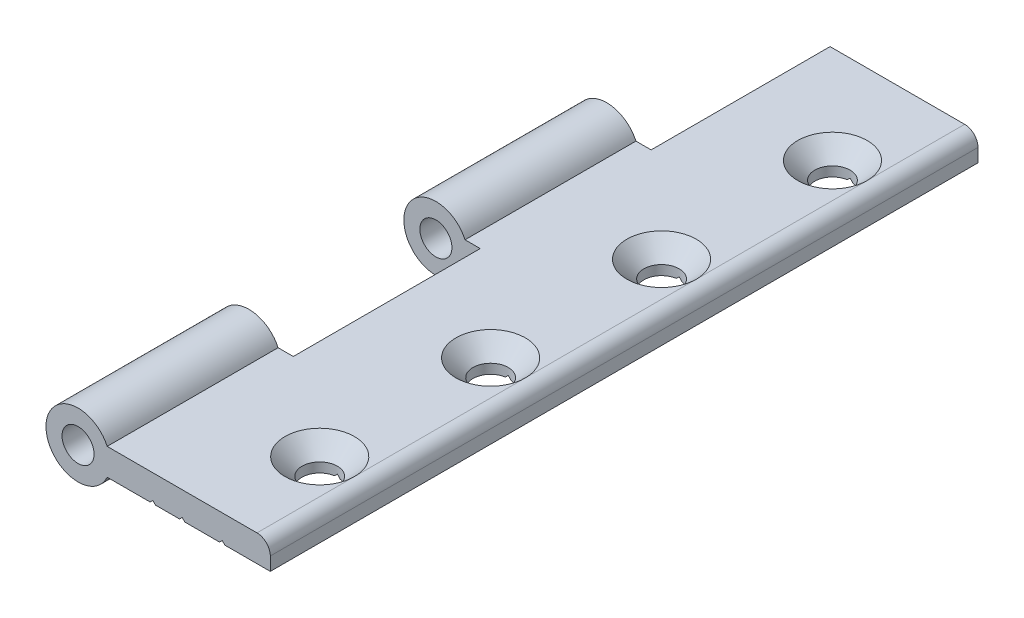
ISO-10303-21;
HEADER;
FILE_DESCRIPTION(('STEP AP214'),'2;1');
FILE_NAME('part.step','',(''),(''),'','','');
FILE_SCHEMA(('AUTOMOTIVE_DESIGN { 1 0 10303 214 1 1 1 1 }'));
ENDSEC;
DATA;
#1=APPLICATION_CONTEXT('core data for automotive mechanical design processes');
#2=APPLICATION_PROTOCOL_DEFINITION('international standard','automotive_design',2000,#1);
#3=PRODUCT_CONTEXT('',#1,'mechanical');
#4=PRODUCT('Part','Part','',(#3));
#5=PRODUCT_RELATED_PRODUCT_CATEGORY('part','',(#4));
#6=PRODUCT_DEFINITION_FORMATION('','',#4);
#7=PRODUCT_DEFINITION_CONTEXT('part definition',#1,'design');
#8=PRODUCT_DEFINITION('design','',#6,#7);
#9=PRODUCT_DEFINITION_SHAPE('','',#8);
#10=(LENGTH_UNIT() NAMED_UNIT(*) SI_UNIT(.MILLI.,.METRE.));
#11=(NAMED_UNIT(*) PLANE_ANGLE_UNIT() SI_UNIT($,.RADIAN.));
#12=(NAMED_UNIT(*) SI_UNIT($,.STERADIAN.) SOLID_ANGLE_UNIT());
#13=UNCERTAINTY_MEASURE_WITH_UNIT(LENGTH_MEASURE(1.E-05),#10,'distance_accuracy_value','');
#14=(GEOMETRIC_REPRESENTATION_CONTEXT(3) GLOBAL_UNCERTAINTY_ASSIGNED_CONTEXT((#13)) GLOBAL_UNIT_ASSIGNED_CONTEXT((#10,
#11,#12)) REPRESENTATION_CONTEXT('',''));
#15=CARTESIAN_POINT('',(0.,0.,0.));
#16=DIRECTION('',(0.,0.,1.));
#17=DIRECTION('',(1.,0.,0.));
#18=AXIS2_PLACEMENT_3D('',#15,#16,#17);
#19=CARTESIAN_POINT('',(27.,2.5,18.25));
#20=DIRECTION('',(0.,1.,0.));
#21=DIRECTION('',(-1.,0.,0.));
#22=AXIS2_PLACEMENT_3D('',#19,#20,#21);
#23=CONICAL_SURFACE('',#22,6.50000000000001,0.785398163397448);
#24=CARTESIAN_POINT('',(27.,-0.700000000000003,18.25));
#25=DIRECTION('',(0.,1.,0.));
#26=DIRECTION('',(0.,0.,1.));
#27=AXIS2_PLACEMENT_3D('',#24,#25,#26);
#28=CIRCLE('',#27,3.3);
#29=CARTESIAN_POINT('',(27.,-0.700000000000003,21.55));
#30=VERTEX_POINT('',#29);
#31=EDGE_CURVE('E303',#30,#30,#28,.T.);
#32=ORIENTED_EDGE('',*,*,#31,.F.);
#33=EDGE_LOOP('',(#32));
#34=FACE_BOUND('',#33,.T.);
#35=CARTESIAN_POINT('',(27.,2.5,18.25));
#36=DIRECTION('',(0.,1.,0.));
#37=DIRECTION('',(-1.,0.,0.));
#38=AXIS2_PLACEMENT_3D('',#35,#36,#37);
#39=CIRCLE('',#38,6.5);
#40=CARTESIAN_POINT('',(33.5,2.5,18.25));
#41=VERTEX_POINT('',#40);
#42=EDGE_CURVE('E100',#41,#41,#39,.T.);
#43=ORIENTED_EDGE('',*,*,#42,.T.);
#44=EDGE_LOOP('',(#43));
#45=FACE_BOUND('',#44,.T.);
#46=ADVANCED_FACE('F15',(#34,#45),#23,.F.);
#47=CARTESIAN_POINT('',(27.,-0.699999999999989,18.25));
#48=DIRECTION('',(0.,-1.,0.));
#49=DIRECTION('',(0.,0.,-1.));
#50=AXIS2_PLACEMENT_3D('',#47,#48,#49);
#51=CYLINDRICAL_SURFACE('',#50,3.3);
#52=ORIENTED_EDGE('',*,*,#31,.T.);
#53=EDGE_LOOP('',(#52));
#54=FACE_BOUND('',#53,.T.);
#55=CARTESIAN_POINT('',(27.,-1.99999999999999,18.25));
#56=DIRECTION('',(-0.707106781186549,-0.707106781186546,0.));
#57=DIRECTION('',(0.707106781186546,-0.707106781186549,0.));
#58=AXIS2_PLACEMENT_3D('',#55,#56,#57);
#59=ELLIPSE('',#58,4.66690475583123,3.3);
#60=CARTESIAN_POINT('',(27.,-1.99999999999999,21.55));
#61=VERTEX_POINT('',#60);
#62=CARTESIAN_POINT('',(27.5,-2.5,21.51190128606));
#63=VERTEX_POINT('',#62);
#64=EDGE_CURVE('E291',#61,#63,#59,.F.);
#65=ORIENTED_EDGE('',*,*,#64,.F.);
#66=CARTESIAN_POINT('',(27.,-2.,18.25));
#67=DIRECTION('',(0.707106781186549,-0.707106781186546,0.));
#68=DIRECTION('',(-0.707106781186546,-0.707106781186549,0.));
#69=AXIS2_PLACEMENT_3D('',#66,#67,#68);
#70=ELLIPSE('',#69,4.66690475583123,3.3);
#71=CARTESIAN_POINT('',(26.5,-2.5,21.51190128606));
#72=VERTEX_POINT('',#71);
#73=EDGE_CURVE('E294',#72,#61,#70,.F.);
#74=ORIENTED_EDGE('',*,*,#73,.F.);
#75=CARTESIAN_POINT('',(27.,-2.5,18.25));
#76=DIRECTION('',(0.,-1.,0.));
#77=DIRECTION('',(0.,0.,-1.));
#78=AXIS2_PLACEMENT_3D('',#75,#76,#77);
#79=CIRCLE('',#78,3.3);
#80=CARTESIAN_POINT('',(26.5,-2.5,14.98809871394));
#81=VERTEX_POINT('',#80);
#82=EDGE_CURVE('E314',#81,#72,#79,.F.);
#83=ORIENTED_EDGE('',*,*,#82,.F.);
#84=CARTESIAN_POINT('',(27.,-2.,18.25));
#85=DIRECTION('',(0.707106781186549,-0.707106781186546,0.));
#86=DIRECTION('',(-0.707106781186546,-0.707106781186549,0.));
#87=AXIS2_PLACEMENT_3D('',#84,#85,#86);
#88=ELLIPSE('',#87,4.66690475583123,3.3);
#89=CARTESIAN_POINT('',(27.,-1.99999999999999,14.95));
#90=VERTEX_POINT('',#89);
#91=EDGE_CURVE('E428',#90,#81,#88,.F.);
#92=ORIENTED_EDGE('',*,*,#91,.F.);
#93=CARTESIAN_POINT('',(27.,-1.99999999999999,18.25));
#94=DIRECTION('',(-0.707106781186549,-0.707106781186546,0.));
#95=DIRECTION('',(0.707106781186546,-0.707106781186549,0.));
#96=AXIS2_PLACEMENT_3D('',#93,#94,#95);
#97=ELLIPSE('',#96,4.66690475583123,3.3);
#98=CARTESIAN_POINT('',(27.5,-2.5,14.98809871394));
#99=VERTEX_POINT('',#98);
#100=EDGE_CURVE('E696',#99,#90,#97,.F.);
#101=ORIENTED_EDGE('',*,*,#100,.F.);
#102=CARTESIAN_POINT('',(27.,-2.5,18.25));
#103=DIRECTION('',(0.,-1.,0.));
#104=DIRECTION('',(0.,0.,-1.));
#105=AXIS2_PLACEMENT_3D('',#102,#103,#104);
#106=CIRCLE('',#105,3.3);
#107=EDGE_CURVE('E297',#63,#99,#106,.F.);
#108=ORIENTED_EDGE('',*,*,#107,.F.);
#109=EDGE_LOOP('',(#65,#74,#83,#92,#101,#108));
#110=FACE_BOUND('',#109,.T.);
#111=ADVANCED_FACE('F293',(#54,#110),#51,.F.);
#112=CARTESIAN_POINT('',(27.,2.5,50.25));
#113=DIRECTION('',(0.,1.,0.));
#114=DIRECTION('',(0.,0.,1.));
#115=AXIS2_PLACEMENT_3D('',#112,#113,#114);
#116=CONICAL_SURFACE('',#115,6.50000000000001,0.785398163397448);
#117=CARTESIAN_POINT('',(27.,-0.700000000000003,50.25));
#118=DIRECTION('',(0.,1.,0.));
#119=DIRECTION('',(0.,0.,1.));
#120=AXIS2_PLACEMENT_3D('',#117,#118,#119);
#121=CIRCLE('',#120,3.30000000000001);
#122=CARTESIAN_POINT('',(27.,-0.700000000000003,53.55));
#123=VERTEX_POINT('',#122);
#124=EDGE_CURVE('E620',#123,#123,#121,.T.);
#125=ORIENTED_EDGE('',*,*,#124,.F.);
#126=EDGE_LOOP('',(#125));
#127=FACE_BOUND('',#126,.T.);
#128=CARTESIAN_POINT('',(27.,2.49999999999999,50.25));
#129=DIRECTION('',(0.,1.,0.));
#130=DIRECTION('',(0.,0.,1.));
#131=AXIS2_PLACEMENT_3D('',#128,#129,#130);
#132=CIRCLE('',#131,6.5);
#133=CARTESIAN_POINT('',(33.5,2.5,50.25));
#134=VERTEX_POINT('',#133);
#135=EDGE_CURVE('E10',#134,#134,#132,.T.);
#136=ORIENTED_EDGE('',*,*,#135,.T.);
#137=EDGE_LOOP('',(#136));
#138=FACE_BOUND('',#137,.T.);
#139=ADVANCED_FACE('F714',(#127,#138),#116,.F.);
#140=CARTESIAN_POINT('',(27.,-0.699999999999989,50.25));
#141=DIRECTION('',(0.,-1.,0.));
#142=DIRECTION('',(0.,0.,-1.));
#143=AXIS2_PLACEMENT_3D('',#140,#141,#142);
#144=CYLINDRICAL_SURFACE('',#143,3.30000000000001);
#145=ORIENTED_EDGE('',*,*,#124,.T.);
#146=EDGE_LOOP('',(#145));
#147=FACE_BOUND('',#146,.T.);
#148=CARTESIAN_POINT('',(27.,-2.,50.25));
#149=DIRECTION('',(-0.707106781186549,-0.707106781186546,0.));
#150=DIRECTION('',(0.707106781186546,-0.707106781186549,0.));
#151=AXIS2_PLACEMENT_3D('',#148,#149,#150);
#152=ELLIPSE('',#151,4.66690475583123,3.30000000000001);
#153=CARTESIAN_POINT('',(27.,-1.99999999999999,53.55));
#154=VERTEX_POINT('',#153);
#155=CARTESIAN_POINT('',(27.5,-2.5,53.51190128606));
#156=VERTEX_POINT('',#155);
#157=EDGE_CURVE('E616',#154,#156,#152,.F.);
#158=ORIENTED_EDGE('',*,*,#157,.F.);
#159=CARTESIAN_POINT('',(27.,-2.,50.25));
#160=DIRECTION('',(0.707106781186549,-0.707106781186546,0.));
#161=DIRECTION('',(-0.707106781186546,-0.707106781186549,0.));
#162=AXIS2_PLACEMENT_3D('',#159,#160,#161);
#163=ELLIPSE('',#162,4.66690475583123,3.30000000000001);
#164=CARTESIAN_POINT('',(26.5,-2.5,53.51190128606));
#165=VERTEX_POINT('',#164);
#166=EDGE_CURVE('E619',#165,#154,#163,.F.);
#167=ORIENTED_EDGE('',*,*,#166,.F.);
#168=CARTESIAN_POINT('',(27.,-2.5,50.25));
#169=DIRECTION('',(0.,-1.,0.));
#170=DIRECTION('',(0.,0.,-1.));
#171=AXIS2_PLACEMENT_3D('',#168,#169,#170);
#172=CIRCLE('',#171,3.30000000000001);
#173=CARTESIAN_POINT('',(26.5,-2.5,46.98809871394));
#174=VERTEX_POINT('',#173);
#175=EDGE_CURVE('E687',#174,#165,#172,.F.);
#176=ORIENTED_EDGE('',*,*,#175,.F.);
#177=CARTESIAN_POINT('',(27.,-2.,50.25));
#178=DIRECTION('',(0.707106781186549,-0.707106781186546,0.));
#179=DIRECTION('',(-0.707106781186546,-0.707106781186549,0.));
#180=AXIS2_PLACEMENT_3D('',#177,#178,#179);
#181=ELLIPSE('',#180,4.66690475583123,3.30000000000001);
#182=CARTESIAN_POINT('',(27.,-1.99999999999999,46.95));
#183=VERTEX_POINT('',#182);
#184=EDGE_CURVE('E629',#183,#174,#181,.F.);
#185=ORIENTED_EDGE('',*,*,#184,.F.);
#186=CARTESIAN_POINT('',(27.,-2.,50.25));
#187=DIRECTION('',(-0.707106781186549,-0.707106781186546,0.));
#188=DIRECTION('',(0.707106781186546,-0.707106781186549,0.));
#189=AXIS2_PLACEMENT_3D('',#186,#187,#188);
#190=ELLIPSE('',#189,4.66690475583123,3.30000000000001);
#191=CARTESIAN_POINT('',(27.5,-2.5,46.98809871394));
#192=VERTEX_POINT('',#191);
#193=EDGE_CURVE('E318',#192,#183,#190,.F.);
#194=ORIENTED_EDGE('',*,*,#193,.F.);
#195=CARTESIAN_POINT('',(27.,-2.5,50.25));
#196=DIRECTION('',(0.,-1.,0.));
#197=DIRECTION('',(0.,0.,-1.));
#198=AXIS2_PLACEMENT_3D('',#195,#196,#197);
#199=CIRCLE('',#198,3.30000000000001);
#200=EDGE_CURVE('E609',#156,#192,#199,.F.);
#201=ORIENTED_EDGE('',*,*,#200,.F.);
#202=EDGE_LOOP('',(#158,#167,#176,#185,#194,#201));
#203=FACE_BOUND('',#202,.T.);
#204=ADVANCED_FACE('F622',(#147,#203),#144,.F.);
#205=CARTESIAN_POINT('',(27.,2.5,82.25));
#206=DIRECTION('',(0.,1.,0.));
#207=DIRECTION('',(0.,0.,1.));
#208=AXIS2_PLACEMENT_3D('',#205,#206,#207);
#209=CONICAL_SURFACE('',#208,6.5,0.785398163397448);
#210=CARTESIAN_POINT('',(27.,-0.700000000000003,82.25));
#211=DIRECTION('',(0.,1.,0.));
#212=DIRECTION('',(0.,0.,1.));
#213=AXIS2_PLACEMENT_3D('',#210,#211,#212);
#214=CIRCLE('',#213,3.3);
#215=CARTESIAN_POINT('',(27.,-0.700000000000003,85.55));
#216=VERTEX_POINT('',#215);
#217=EDGE_CURVE('E623',#216,#216,#214,.T.);
#218=ORIENTED_EDGE('',*,*,#217,.F.);
#219=EDGE_LOOP('',(#218));
#220=FACE_BOUND('',#219,.T.);
#221=CARTESIAN_POINT('',(27.,2.5,82.25));
#222=DIRECTION('',(0.,1.,0.));
#223=DIRECTION('',(0.,0.,1.));
#224=AXIS2_PLACEMENT_3D('',#221,#222,#223);
#225=CIRCLE('',#224,6.5);
#226=CARTESIAN_POINT('',(33.5,2.5,82.25));
#227=VERTEX_POINT('',#226);
#228=EDGE_CURVE('E377',#227,#227,#225,.T.);
#229=ORIENTED_EDGE('',*,*,#228,.T.);
#230=EDGE_LOOP('',(#229));
#231=FACE_BOUND('',#230,.T.);
#232=ADVANCED_FACE('F834',(#220,#231),#209,.F.);
#233=CARTESIAN_POINT('',(27.,-0.699999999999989,82.25));
#234=DIRECTION('',(0.,-1.,0.));
#235=DIRECTION('',(0.,0.,-1.));
#236=AXIS2_PLACEMENT_3D('',#233,#234,#235);
#237=CYLINDRICAL_SURFACE('',#236,3.3);
#238=ORIENTED_EDGE('',*,*,#217,.T.);
#239=EDGE_LOOP('',(#238));
#240=FACE_BOUND('',#239,.T.);
#241=CARTESIAN_POINT('',(27.,-1.99999999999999,82.25));
#242=DIRECTION('',(-0.707106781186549,-0.707106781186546,0.));
#243=DIRECTION('',(0.707106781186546,-0.707106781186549,0.));
#244=AXIS2_PLACEMENT_3D('',#241,#242,#243);
#245=ELLIPSE('',#244,4.66690475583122,3.3);
#246=CARTESIAN_POINT('',(27.,-1.99999999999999,85.55));
#247=VERTEX_POINT('',#246);
#248=CARTESIAN_POINT('',(27.5,-2.5,85.51190128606));
#249=VERTEX_POINT('',#248);
#250=EDGE_CURVE('E627',#247,#249,#245,.F.);
#251=ORIENTED_EDGE('',*,*,#250,.F.);
#252=CARTESIAN_POINT('',(27.,-2.,82.25));
#253=DIRECTION('',(0.707106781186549,-0.707106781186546,0.));
#254=DIRECTION('',(-0.707106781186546,-0.707106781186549,0.));
#255=AXIS2_PLACEMENT_3D('',#252,#253,#254);
#256=ELLIPSE('',#255,4.66690475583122,3.3);
#257=CARTESIAN_POINT('',(26.5,-2.5,85.51190128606));
#258=VERTEX_POINT('',#257);
#259=EDGE_CURVE('E637',#258,#247,#256,.F.);
#260=ORIENTED_EDGE('',*,*,#259,.F.);
#261=CARTESIAN_POINT('',(27.,-2.5,82.25));
#262=DIRECTION('',(0.,-1.,0.));
#263=DIRECTION('',(0.,0.,-1.));
#264=AXIS2_PLACEMENT_3D('',#261,#262,#263);
#265=CIRCLE('',#264,3.3);
#266=CARTESIAN_POINT('',(26.5,-2.5,78.98809871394));
#267=VERTEX_POINT('',#266);
#268=EDGE_CURVE('E641',#267,#258,#265,.F.);
#269=ORIENTED_EDGE('',*,*,#268,.F.);
#270=CARTESIAN_POINT('',(27.,-2.,82.25));
#271=DIRECTION('',(0.707106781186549,-0.707106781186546,0.));
#272=DIRECTION('',(-0.707106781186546,-0.707106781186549,0.));
#273=AXIS2_PLACEMENT_3D('',#270,#271,#272);
#274=ELLIPSE('',#273,4.66690475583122,3.3);
#275=CARTESIAN_POINT('',(27.,-1.99999999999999,78.95));
#276=VERTEX_POINT('',#275);
#277=EDGE_CURVE('E645',#276,#267,#274,.F.);
#278=ORIENTED_EDGE('',*,*,#277,.F.);
#279=CARTESIAN_POINT('',(27.,-1.99999999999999,82.25));
#280=DIRECTION('',(-0.707106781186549,-0.707106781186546,0.));
#281=DIRECTION('',(0.707106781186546,-0.707106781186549,0.));
#282=AXIS2_PLACEMENT_3D('',#279,#280,#281);
#283=ELLIPSE('',#282,4.66690475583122,3.3);
#284=CARTESIAN_POINT('',(27.5,-2.5,78.98809871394));
#285=VERTEX_POINT('',#284);
#286=EDGE_CURVE('E614',#285,#276,#283,.F.);
#287=ORIENTED_EDGE('',*,*,#286,.F.);
#288=CARTESIAN_POINT('',(27.,-2.5,82.25));
#289=DIRECTION('',(0.,-1.,0.));
#290=DIRECTION('',(0.,0.,-1.));
#291=AXIS2_PLACEMENT_3D('',#288,#289,#290);
#292=CIRCLE('',#291,3.3);
#293=EDGE_CURVE('E611',#249,#285,#292,.F.);
#294=ORIENTED_EDGE('',*,*,#293,.F.);
#295=EDGE_LOOP('',(#251,#260,#269,#278,#287,#294));
#296=FACE_BOUND('',#295,.T.);
#297=ADVANCED_FACE('F679',(#240,#296),#237,.F.);
#298=CARTESIAN_POINT('',(27.,2.5,114.25));
#299=DIRECTION('',(0.,1.,0.));
#300=DIRECTION('',(0.,0.,1.));
#301=AXIS2_PLACEMENT_3D('',#298,#299,#300);
#302=CONICAL_SURFACE('',#301,6.49999999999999,0.785398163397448);
#303=CARTESIAN_POINT('',(27.,-0.700000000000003,114.25));
#304=DIRECTION('',(0.,1.,0.));
#305=DIRECTION('',(0.,0.,1.));
#306=AXIS2_PLACEMENT_3D('',#303,#304,#305);
#307=CIRCLE('',#306,3.30000000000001);
#308=CARTESIAN_POINT('',(27.,-0.700000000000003,117.55));
#309=VERTEX_POINT('',#308);
#310=EDGE_CURVE('E652',#309,#309,#307,.T.);
#311=ORIENTED_EDGE('',*,*,#310,.F.);
#312=EDGE_LOOP('',(#311));
#313=FACE_BOUND('',#312,.T.);
#314=CARTESIAN_POINT('',(27.,2.50000000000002,114.25));
#315=DIRECTION('',(0.,1.,0.));
#316=DIRECTION('',(0.,0.,1.));
#317=AXIS2_PLACEMENT_3D('',#314,#315,#316);
#318=CIRCLE('',#317,6.5);
#319=CARTESIAN_POINT('',(33.5,2.50000000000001,114.25));
#320=VERTEX_POINT('',#319);
#321=EDGE_CURVE('E44',#320,#320,#318,.T.);
#322=ORIENTED_EDGE('',*,*,#321,.T.);
#323=EDGE_LOOP('',(#322));
#324=FACE_BOUND('',#323,.T.);
#325=ADVANCED_FACE('F827',(#313,#324),#302,.F.);
#326=CARTESIAN_POINT('',(27.,-0.699999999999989,114.25));
#327=DIRECTION('',(0.,-1.,0.));
#328=DIRECTION('',(0.,0.,-1.));
#329=AXIS2_PLACEMENT_3D('',#326,#327,#328);
#330=CYLINDRICAL_SURFACE('',#329,3.30000000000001);
#331=ORIENTED_EDGE('',*,*,#310,.T.);
#332=EDGE_LOOP('',(#331));
#333=FACE_BOUND('',#332,.T.);
#334=CARTESIAN_POINT('',(27.,-2.00000000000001,114.25));
#335=DIRECTION('',(-0.707106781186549,-0.707106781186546,0.));
#336=DIRECTION('',(0.707106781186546,-0.707106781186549,0.));
#337=AXIS2_PLACEMENT_3D('',#334,#335,#336);
#338=ELLIPSE('',#337,4.66690475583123,3.30000000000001);
#339=CARTESIAN_POINT('',(27.,-2.,117.55));
#340=VERTEX_POINT('',#339);
#341=CARTESIAN_POINT('',(27.5,-2.5,117.51190128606));
#342=VERTEX_POINT('',#341);
#343=EDGE_CURVE('E655',#340,#342,#338,.F.);
#344=ORIENTED_EDGE('',*,*,#343,.F.);
#345=CARTESIAN_POINT('',(27.,-1.99999999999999,114.25));
#346=DIRECTION('',(0.707106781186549,-0.707106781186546,0.));
#347=DIRECTION('',(-0.707106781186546,-0.707106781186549,0.));
#348=AXIS2_PLACEMENT_3D('',#345,#346,#347);
#349=ELLIPSE('',#348,4.66690475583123,3.30000000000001);
#350=CARTESIAN_POINT('',(26.5,-2.5,117.51190128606));
#351=VERTEX_POINT('',#350);
#352=EDGE_CURVE('E659',#351,#340,#349,.F.);
#353=ORIENTED_EDGE('',*,*,#352,.F.);
#354=CARTESIAN_POINT('',(27.,-2.5,114.25));
#355=DIRECTION('',(0.,-1.,0.));
#356=DIRECTION('',(0.,0.,-1.));
#357=AXIS2_PLACEMENT_3D('',#354,#355,#356);
#358=CIRCLE('',#357,3.30000000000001);
#359=CARTESIAN_POINT('',(26.5,-2.5,110.98809871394));
#360=VERTEX_POINT('',#359);
#361=EDGE_CURVE('E662',#360,#351,#358,.F.);
#362=ORIENTED_EDGE('',*,*,#361,.F.);
#363=CARTESIAN_POINT('',(27.,-1.99999999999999,114.25));
#364=DIRECTION('',(0.707106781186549,-0.707106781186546,0.));
#365=DIRECTION('',(-0.707106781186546,-0.707106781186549,0.));
#366=AXIS2_PLACEMENT_3D('',#363,#364,#365);
#367=ELLIPSE('',#366,4.66690475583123,3.30000000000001);
#368=CARTESIAN_POINT('',(27.,-1.99999999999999,110.95));
#369=VERTEX_POINT('',#368);
#370=EDGE_CURVE('E665',#369,#360,#367,.F.);
#371=ORIENTED_EDGE('',*,*,#370,.F.);
#372=CARTESIAN_POINT('',(27.,-2.00000000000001,114.25));
#373=DIRECTION('',(-0.707106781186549,-0.707106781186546,0.));
#374=DIRECTION('',(0.707106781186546,-0.707106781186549,0.));
#375=AXIS2_PLACEMENT_3D('',#372,#373,#374);
#376=ELLIPSE('',#375,4.66690475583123,3.30000000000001);
#377=CARTESIAN_POINT('',(27.5,-2.5,110.98809871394));
#378=VERTEX_POINT('',#377);
#379=EDGE_CURVE('E667',#378,#369,#376,.F.);
#380=ORIENTED_EDGE('',*,*,#379,.F.);
#381=CARTESIAN_POINT('',(27.,-2.5,114.25));
#382=DIRECTION('',(0.,-1.,0.));
#383=DIRECTION('',(0.,0.,-1.));
#384=AXIS2_PLACEMENT_3D('',#381,#382,#383);
#385=CIRCLE('',#384,3.30000000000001);
#386=EDGE_CURVE('E375',#342,#378,#385,.F.);
#387=ORIENTED_EDGE('',*,*,#386,.F.);
#388=EDGE_LOOP('',(#344,#353,#362,#371,#380,#387));
#389=FACE_BOUND('',#388,.T.);
#390=ADVANCED_FACE('F824',(#333,#389),#330,.F.);
#391=CARTESIAN_POINT('',(14.3886766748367,-0.053688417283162,0.));
#392=DIRECTION('',(0.,0.,1.));
#393=DIRECTION('',(1.,0.,0.));
#394=AXIS2_PLACEMENT_3D('',#391,#392,#393);
#395=PLANE('',#394);
#396=DIRECTION('',(1.,0.,0.));
#397=VECTOR('',#396,1.);
#398=CARTESIAN_POINT('',(20.9,2.5,0.));
#399=LINE('',#398,#397);
#400=CARTESIAN_POINT('',(8.29999999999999,2.5,0.));
#401=VERTEX_POINT('',#400);
#402=CARTESIAN_POINT('',(33.4999998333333,2.5,0.));
#403=VERTEX_POINT('',#402);
#404=EDGE_CURVE('E92',#401,#403,#399,.T.);
#405=ORIENTED_EDGE('',*,*,#404,.T.);
#406=CARTESIAN_POINT('',(33.5,0.,0.));
#407=DIRECTION('',(0.,0.,1.));
#408=DIRECTION('',(1.,0.,0.));
#409=AXIS2_PLACEMENT_3D('',#406,#407,#408);
#410=CIRCLE('',#409,2.5);
#411=CARTESIAN_POINT('',(36.,0.,0.));
#412=VERTEX_POINT('',#411);
#413=EDGE_CURVE('E372',#412,#403,#410,.T.);
#414=ORIENTED_EDGE('',*,*,#413,.F.);
#415=DIRECTION('',(0.,1.,0.));
#416=VECTOR('',#415,1.);
#417=CARTESIAN_POINT('',(36.,-0.053688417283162,0.));
#418=LINE('',#417,#416);
#419=CARTESIAN_POINT('',(36.,-2.5,0.));
#420=VERTEX_POINT('',#419);
#421=EDGE_CURVE('E374',#420,#412,#418,.T.);
#422=ORIENTED_EDGE('',*,*,#421,.F.);
#423=DIRECTION('',(1.,0.,0.));
#424=VECTOR('',#423,1.);
#425=CARTESIAN_POINT('',(14.3886766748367,-2.5,0.));
#426=LINE('',#425,#424);
#427=CARTESIAN_POINT('',(27.5,-2.5,0.));
#428=VERTEX_POINT('',#427);
#429=EDGE_CURVE('E510',#428,#420,#426,.T.);
#430=ORIENTED_EDGE('',*,*,#429,.F.);
#431=DIRECTION('',(0.707106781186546,-0.707106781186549,0.));
#432=VECTOR('',#431,1.);
#433=CARTESIAN_POINT('',(27.5,-2.5,0.));
#434=LINE('',#433,#432);
#435=CARTESIAN_POINT('',(27.,-1.99999999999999,0.));
#436=VERTEX_POINT('',#435);
#437=EDGE_CURVE('E512',#436,#428,#434,.T.);
#438=ORIENTED_EDGE('',*,*,#437,.F.);
#439=DIRECTION('',(0.707106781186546,0.707106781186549,0.));
#440=VECTOR('',#439,1.);
#441=CARTESIAN_POINT('',(27.,-2.,0.));
#442=LINE('',#441,#440);
#443=CARTESIAN_POINT('',(26.5,-2.5,0.));
#444=VERTEX_POINT('',#443);
#445=EDGE_CURVE('E516',#444,#436,#442,.T.);
#446=ORIENTED_EDGE('',*,*,#445,.F.);
#447=DIRECTION('',(1.,0.,0.));
#448=VECTOR('',#447,1.);
#449=CARTESIAN_POINT('',(14.3886766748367,-2.5,0.));
#450=LINE('',#449,#448);
#451=CARTESIAN_POINT('',(20.,-2.5,0.));
#452=VERTEX_POINT('',#451);
#453=EDGE_CURVE('E521',#452,#444,#450,.T.);
#454=ORIENTED_EDGE('',*,*,#453,.F.);
#455=DIRECTION('',(0.707106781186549,-0.707106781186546,0.));
#456=VECTOR('',#455,1.);
#457=CARTESIAN_POINT('',(20.,-2.5,0.));
#458=LINE('',#457,#456);
#459=CARTESIAN_POINT('',(19.5,-2.,0.));
#460=VERTEX_POINT('',#459);
#461=EDGE_CURVE('E530',#460,#452,#458,.T.);
#462=ORIENTED_EDGE('',*,*,#461,.F.);
#463=DIRECTION('',(0.707106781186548,0.707106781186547,0.));
#464=VECTOR('',#463,1.);
#465=CARTESIAN_POINT('',(19.5,-2.,0.));
#466=LINE('',#465,#464);
#467=CARTESIAN_POINT('',(19.,-2.5,0.));
#468=VERTEX_POINT('',#467);
#469=EDGE_CURVE('E542',#468,#460,#466,.T.);
#470=ORIENTED_EDGE('',*,*,#469,.F.);
#471=DIRECTION('',(1.,0.,0.));
#472=VECTOR('',#471,1.);
#473=CARTESIAN_POINT('',(14.3886766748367,-2.5,0.));
#474=LINE('',#473,#472);
#475=CARTESIAN_POINT('',(14.5,-2.5,0.));
#476=VERTEX_POINT('',#475);
#477=EDGE_CURVE('E545',#476,#468,#474,.T.);
#478=ORIENTED_EDGE('',*,*,#477,.F.);
#479=DIRECTION('',(0.707106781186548,-0.707106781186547,0.));
#480=VECTOR('',#479,1.);
#481=CARTESIAN_POINT('',(14.5,-2.5,0.));
#482=LINE('',#481,#480);
#483=CARTESIAN_POINT('',(14.,-2.,0.));
#484=VERTEX_POINT('',#483);
#485=EDGE_CURVE('E548',#484,#476,#482,.T.);
#486=ORIENTED_EDGE('',*,*,#485,.F.);
#487=DIRECTION('',(0.707106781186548,0.707106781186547,0.));
#488=VECTOR('',#487,1.);
#489=CARTESIAN_POINT('',(14.,-2.,0.));
#490=LINE('',#489,#488);
#491=CARTESIAN_POINT('',(13.5,-2.5,0.));
#492=VERTEX_POINT('',#491);
#493=EDGE_CURVE('E551',#492,#484,#490,.T.);
#494=ORIENTED_EDGE('',*,*,#493,.F.);
#495=DIRECTION('',(1.,0.,0.));
#496=VECTOR('',#495,1.);
#497=CARTESIAN_POINT('',(14.3886766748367,-2.5,0.));
#498=LINE('',#497,#496);
#499=CARTESIAN_POINT('',(8.29999999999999,-2.5,0.));
#500=VERTEX_POINT('',#499);
#501=EDGE_CURVE('E371',#500,#492,#498,.T.);
#502=ORIENTED_EDGE('',*,*,#501,.F.);
#503=DIRECTION('',(0.,1.,0.));
#504=VECTOR('',#503,1.);
#505=CARTESIAN_POINT('',(8.29999999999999,-0.053688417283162,0.));
#506=LINE('',#505,#504);
#507=EDGE_CURVE('E341',#401,#500,#506,.F.);
#508=ORIENTED_EDGE('',*,*,#507,.F.);
#509=EDGE_LOOP('',(#405,#414,#422,#430,#438,#446,#454,#462,#470,#478,#486,#494,#502,#508));
#510=FACE_BOUND('',#509,.T.);
#511=ADVANCED_FACE('F821',(#510),#395,.F.);
#512=CARTESIAN_POINT('',(33.5,0.,0.));
#513=DIRECTION('',(0.,0.,1.));
#514=DIRECTION('',(1.,0.,0.));
#515=AXIS2_PLACEMENT_3D('',#512,#513,#514);
#516=CYLINDRICAL_SURFACE('',#515,2.5);
#517=ORIENTED_EDGE('',*,*,#413,.T.);
#518=DIRECTION('',(0.,0.,1.));
#519=VECTOR('',#518,1.);
#520=CARTESIAN_POINT('',(33.5,2.5,66.25));
#521=LINE('',#520,#519);
#522=EDGE_CURVE('E384',#403,#41,#521,.T.);
#523=ORIENTED_EDGE('',*,*,#522,.T.);
#524=DIRECTION('',(0.,0.,1.));
#525=VECTOR('',#524,1.);
#526=CARTESIAN_POINT('',(33.5,2.5,66.25));
#527=LINE('',#526,#525);
#528=EDGE_CURVE('E19',#41,#134,#527,.T.);
#529=ORIENTED_EDGE('',*,*,#528,.T.);
#530=DIRECTION('',(0.,0.,1.));
#531=VECTOR('',#530,1.);
#532=CARTESIAN_POINT('',(33.5,2.5,66.25));
#533=LINE('',#532,#531);
#534=EDGE_CURVE('E25',#134,#227,#533,.T.);
#535=ORIENTED_EDGE('',*,*,#534,.T.);
#536=DIRECTION('',(0.,0.,1.));
#537=VECTOR('',#536,1.);
#538=CARTESIAN_POINT('',(33.5,2.5,66.25));
#539=LINE('',#538,#537);
#540=EDGE_CURVE('E380',#227,#320,#539,.T.);
#541=ORIENTED_EDGE('',*,*,#540,.T.);
#542=DIRECTION('',(0.,0.,1.));
#543=VECTOR('',#542,1.);
#544=CARTESIAN_POINT('',(33.5,2.5,66.25));
#545=LINE('',#544,#543);
#546=CARTESIAN_POINT('',(33.5,2.5,132.499999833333));
#547=VERTEX_POINT('',#546);
#548=EDGE_CURVE('E55',#320,#547,#545,.T.);
#549=ORIENTED_EDGE('',*,*,#548,.T.);
#550=CARTESIAN_POINT('',(33.5,0.,132.5));
#551=DIRECTION('',(0.,0.,1.));
#552=DIRECTION('',(1.,0.,0.));
#553=AXIS2_PLACEMENT_3D('',#550,#551,#552);
#554=CIRCLE('',#553,2.5);
#555=CARTESIAN_POINT('',(36.,0.,132.5));
#556=VERTEX_POINT('',#555);
#557=EDGE_CURVE('E337',#547,#556,#554,.F.);
#558=ORIENTED_EDGE('',*,*,#557,.T.);
#559=DIRECTION('',(0.,0.,1.));
#560=VECTOR('',#559,1.);
#561=CARTESIAN_POINT('',(36.,0.,0.));
#562=LINE('',#561,#560);
#563=EDGE_CURVE('E340',#556,#412,#562,.F.);
#564=ORIENTED_EDGE('',*,*,#563,.T.);
#565=EDGE_LOOP('',(#517,#523,#529,#535,#541,#549,#558,#564));
#566=FACE_BOUND('',#565,.T.);
#567=ADVANCED_FACE('F417',(#566),#516,.T.);
#568=CARTESIAN_POINT('',(14.3886766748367,-0.053688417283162,132.5));
#569=DIRECTION('',(0.,0.,1.));
#570=DIRECTION('',(1.,0.,0.));
#571=AXIS2_PLACEMENT_3D('',#568,#569,#570);
#572=PLANE('',#571);
#573=CARTESIAN_POINT('',(0.,0.,132.5));
#574=DIRECTION('',(0.,0.,1.));
#575=DIRECTION('',(1.,0.,0.));
#576=AXIS2_PLACEMENT_3D('',#573,#574,#575);
#577=CIRCLE('',#576,3.);
#578=CARTESIAN_POINT('',(3.,0.,132.5));
#579=VERTEX_POINT('',#578);
#580=EDGE_CURVE('E453',#579,#579,#577,.F.);
#581=ORIENTED_EDGE('',*,*,#580,.T.);
#582=EDGE_LOOP('',(#581));
#583=FACE_BOUND('',#582,.T.);
#584=DIRECTION('',(0.,1.,0.));
#585=VECTOR('',#584,1.);
#586=CARTESIAN_POINT('',(36.,-0.053688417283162,132.5));
#587=LINE('',#586,#585);
#588=CARTESIAN_POINT('',(36.,-2.5,132.5));
#589=VERTEX_POINT('',#588);
#590=EDGE_CURVE('E345',#589,#556,#587,.T.);
#591=ORIENTED_EDGE('',*,*,#590,.T.);
#592=ORIENTED_EDGE('',*,*,#557,.F.);
#593=DIRECTION('',(1.,0.,0.));
#594=VECTOR('',#593,1.);
#595=CARTESIAN_POINT('',(19.4771780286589,2.5,132.5));
#596=LINE('',#595,#594);
#597=CARTESIAN_POINT('',(5.45435605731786,2.5,132.499999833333));
#598=VERTEX_POINT('',#597);
#599=EDGE_CURVE('E390',#598,#547,#596,.T.);
#600=ORIENTED_EDGE('',*,*,#599,.F.);
#601=CARTESIAN_POINT('',(0.,0.,132.5));
#602=DIRECTION('',(0.,0.,1.));
#603=DIRECTION('',(1.,0.,0.));
#604=AXIS2_PLACEMENT_3D('',#601,#602,#603);
#605=CIRCLE('',#604,6.);
#606=CARTESIAN_POINT('',(5.45435605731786,-2.5,132.5));
#607=VERTEX_POINT('',#606);
#608=EDGE_CURVE('E342',#598,#607,#605,.T.);
#609=ORIENTED_EDGE('',*,*,#608,.T.);
#610=DIRECTION('',(1.,0.,0.));
#611=VECTOR('',#610,1.);
#612=CARTESIAN_POINT('',(14.3886766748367,-2.5,132.5));
#613=LINE('',#612,#611);
#614=CARTESIAN_POINT('',(13.5,-2.5,132.5));
#615=VERTEX_POINT('',#614);
#616=EDGE_CURVE('E344',#607,#615,#613,.T.);
#617=ORIENTED_EDGE('',*,*,#616,.T.);
#618=DIRECTION('',(0.707106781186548,0.707106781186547,0.));
#619=VECTOR('',#618,1.);
#620=CARTESIAN_POINT('',(14.,-2.,132.5));
#621=LINE('',#620,#619);
#622=CARTESIAN_POINT('',(14.,-2.,132.5));
#623=VERTEX_POINT('',#622);
#624=EDGE_CURVE('E496',#623,#615,#621,.F.);
#625=ORIENTED_EDGE('',*,*,#624,.F.);
#626=DIRECTION('',(0.707106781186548,-0.707106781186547,0.));
#627=VECTOR('',#626,1.);
#628=CARTESIAN_POINT('',(14.5,-2.5,132.5));
#629=LINE('',#628,#627);
#630=CARTESIAN_POINT('',(14.5,-2.5,132.5));
#631=VERTEX_POINT('',#630);
#632=EDGE_CURVE('E491',#631,#623,#629,.F.);
#633=ORIENTED_EDGE('',*,*,#632,.F.);
#634=DIRECTION('',(1.,0.,0.));
#635=VECTOR('',#634,1.);
#636=CARTESIAN_POINT('',(14.3886766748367,-2.5,132.5));
#637=LINE('',#636,#635);
#638=CARTESIAN_POINT('',(19.,-2.5,132.5));
#639=VERTEX_POINT('',#638);
#640=EDGE_CURVE('E488',#631,#639,#637,.T.);
#641=ORIENTED_EDGE('',*,*,#640,.T.);
#642=DIRECTION('',(0.707106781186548,0.707106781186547,0.));
#643=VECTOR('',#642,1.);
#644=CARTESIAN_POINT('',(19.5,-2.,132.5));
#645=LINE('',#644,#643);
#646=CARTESIAN_POINT('',(19.5,-2.,132.5));
#647=VERTEX_POINT('',#646);
#648=EDGE_CURVE('E485',#647,#639,#645,.F.);
#649=ORIENTED_EDGE('',*,*,#648,.F.);
#650=DIRECTION('',(0.707106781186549,-0.707106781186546,0.));
#651=VECTOR('',#650,1.);
#652=CARTESIAN_POINT('',(20.,-2.5,132.5));
#653=LINE('',#652,#651);
#654=CARTESIAN_POINT('',(20.,-2.5,132.5));
#655=VERTEX_POINT('',#654);
#656=EDGE_CURVE('E483',#655,#647,#653,.F.);
#657=ORIENTED_EDGE('',*,*,#656,.F.);
#658=DIRECTION('',(1.,0.,0.));
#659=VECTOR('',#658,1.);
#660=CARTESIAN_POINT('',(14.3886766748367,-2.5,132.5));
#661=LINE('',#660,#659);
#662=CARTESIAN_POINT('',(26.5,-2.5,132.5));
#663=VERTEX_POINT('',#662);
#664=EDGE_CURVE('E460',#655,#663,#661,.T.);
#665=ORIENTED_EDGE('',*,*,#664,.T.);
#666=DIRECTION('',(0.707106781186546,0.707106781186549,0.));
#667=VECTOR('',#666,1.);
#668=CARTESIAN_POINT('',(27.,-2.,132.5));
#669=LINE('',#668,#667);
#670=CARTESIAN_POINT('',(27.,-1.99999999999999,132.5));
#671=VERTEX_POINT('',#670);
#672=EDGE_CURVE('E456',#671,#663,#669,.F.);
#673=ORIENTED_EDGE('',*,*,#672,.F.);
#674=DIRECTION('',(0.707106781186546,-0.707106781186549,0.));
#675=VECTOR('',#674,1.);
#676=CARTESIAN_POINT('',(27.5,-2.5,132.5));
#677=LINE('',#676,#675);
#678=CARTESIAN_POINT('',(27.5,-2.5,132.5));
#679=VERTEX_POINT('',#678);
#680=EDGE_CURVE('E459',#679,#671,#677,.F.);
#681=ORIENTED_EDGE('',*,*,#680,.F.);
#682=DIRECTION('',(1.,0.,0.));
#683=VECTOR('',#682,1.);
#684=CARTESIAN_POINT('',(14.3886766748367,-2.5,132.5));
#685=LINE('',#684,#683);
#686=EDGE_CURVE('E349',#679,#589,#685,.T.);
#687=ORIENTED_EDGE('',*,*,#686,.T.);
#688=EDGE_LOOP('',(#591,#592,#600,#609,#617,#625,#633,#641,#649,#657,#665,#673,#681,#687));
#689=FACE_BOUND('',#688,.T.);
#690=ADVANCED_FACE('F815',(#583,#689),#572,.T.);
#691=CARTESIAN_POINT('',(0.,0.,0.));
#692=DIRECTION('',(0.,0.,1.));
#693=DIRECTION('',(1.,0.,0.));
#694=AXIS2_PLACEMENT_3D('',#691,#692,#693);
#695=CYLINDRICAL_SURFACE('',#694,6.);
#696=ORIENTED_EDGE('',*,*,#608,.F.);
#697=DIRECTION('',(0.,0.,1.));
#698=VECTOR('',#697,1.);
#699=CARTESIAN_POINT('',(5.45435605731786,2.5,116.5));
#700=LINE('',#699,#698);
#701=CARTESIAN_POINT('',(5.45435605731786,2.5,100.5));
#702=VERTEX_POINT('',#701);
#703=EDGE_CURVE('E394',#702,#598,#700,.T.);
#704=ORIENTED_EDGE('',*,*,#703,.F.);
#705=CARTESIAN_POINT('',(0.,0.,100.5));
#706=DIRECTION('',(0.,0.,1.));
#707=DIRECTION('',(1.,0.,0.));
#708=AXIS2_PLACEMENT_3D('',#705,#706,#707);
#709=CIRCLE('',#708,6.);
#710=CARTESIAN_POINT('',(5.45435605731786,-2.5,100.5));
#711=VERTEX_POINT('',#710);
#712=EDGE_CURVE('E346',#702,#711,#709,.T.);
#713=ORIENTED_EDGE('',*,*,#712,.T.);
#714=DIRECTION('',(0.,0.,1.));
#715=VECTOR('',#714,1.);
#716=CARTESIAN_POINT('',(5.45435605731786,-2.5,0.));
#717=LINE('',#716,#715);
#718=EDGE_CURVE('E348',#711,#607,#717,.T.);
#719=ORIENTED_EDGE('',*,*,#718,.T.);
#720=EDGE_LOOP('',(#696,#704,#713,#719));
#721=FACE_BOUND('',#720,.T.);
#722=ADVANCED_FACE('F811',(#721),#695,.T.);
#723=CARTESIAN_POINT('',(-31.1129485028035,2.5,100.5));
#724=DIRECTION('',(0.,0.,1.));
#725=DIRECTION('',(1.,0.,0.));
#726=AXIS2_PLACEMENT_3D('',#723,#724,#725);
#727=PLANE('',#726);
#728=CARTESIAN_POINT('',(0.,0.,100.5));
#729=DIRECTION('',(0.,0.,1.));
#730=DIRECTION('',(1.,0.,0.));
#731=AXIS2_PLACEMENT_3D('',#728,#729,#730);
#732=CIRCLE('',#731,3.);
#733=CARTESIAN_POINT('',(3.,0.,100.5));
#734=VERTEX_POINT('',#733);
#735=EDGE_CURVE('E354',#734,#734,#732,.F.);
#736=ORIENTED_EDGE('',*,*,#735,.F.);
#737=EDGE_LOOP('',(#736));
#738=FACE_BOUND('',#737,.T.);
#739=DIRECTION('',(0.,1.,0.));
#740=VECTOR('',#739,1.);
#741=CARTESIAN_POINT('',(8.30000000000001,2.5,100.5));
#742=LINE('',#741,#740);
#743=CARTESIAN_POINT('',(8.30000000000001,-2.5,100.5));
#744=VERTEX_POINT('',#743);
#745=CARTESIAN_POINT('',(8.29999983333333,2.5,100.5));
#746=VERTEX_POINT('',#745);
#747=EDGE_CURVE('E350',#744,#746,#742,.T.);
#748=ORIENTED_EDGE('',*,*,#747,.F.);
#749=DIRECTION('',(1.,0.,0.));
#750=VECTOR('',#749,1.);
#751=CARTESIAN_POINT('',(-31.1129485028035,-2.5,100.5));
#752=LINE('',#751,#750);
#753=EDGE_CURVE('E353',#711,#744,#752,.T.);
#754=ORIENTED_EDGE('',*,*,#753,.F.);
#755=ORIENTED_EDGE('',*,*,#712,.F.);
#756=DIRECTION('',(1.,0.,0.));
#757=VECTOR('',#756,1.);
#758=CARTESIAN_POINT('',(6.87717802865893,2.5,100.5));
#759=LINE('',#758,#757);
#760=EDGE_CURVE('E397',#702,#746,#759,.T.);
#761=ORIENTED_EDGE('',*,*,#760,.T.);
#762=EDGE_LOOP('',(#748,#754,#755,#761));
#763=FACE_BOUND('',#762,.T.);
#764=ADVANCED_FACE('F807',(#738,#763),#727,.F.);
#765=CARTESIAN_POINT('',(8.30000000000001,2.5,100.5));
#766=DIRECTION('',(1.,0.,0.));
#767=DIRECTION('',(0.,0.,-1.));
#768=AXIS2_PLACEMENT_3D('',#765,#766,#767);
#769=PLANE('',#768);
#770=DIRECTION('',(0.,1.,0.));
#771=VECTOR('',#770,1.);
#772=CARTESIAN_POINT('',(8.30000000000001,2.5,65.5));
#773=LINE('',#772,#771);
#774=CARTESIAN_POINT('',(8.3,-2.5,65.5));
#775=VERTEX_POINT('',#774);
#776=CARTESIAN_POINT('',(8.3,2.5,65.5));
#777=VERTEX_POINT('',#776);
#778=EDGE_CURVE('E355',#775,#777,#773,.T.);
#779=ORIENTED_EDGE('',*,*,#778,.F.);
#780=DIRECTION('',(0.,0.,-1.));
#781=VECTOR('',#780,1.);
#782=CARTESIAN_POINT('',(8.30000000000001,-2.5,100.5));
#783=LINE('',#782,#781);
#784=EDGE_CURVE('E358',#744,#775,#783,.T.);
#785=ORIENTED_EDGE('',*,*,#784,.F.);
#786=ORIENTED_EDGE('',*,*,#747,.T.);
#787=DIRECTION('',(0.,0.,1.));
#788=VECTOR('',#787,1.);
#789=CARTESIAN_POINT('',(8.29999999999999,2.5,83.));
#790=LINE('',#789,#788);
#791=EDGE_CURVE('E399',#777,#746,#790,.T.);
#792=ORIENTED_EDGE('',*,*,#791,.F.);
#793=EDGE_LOOP('',(#779,#785,#786,#792));
#794=FACE_BOUND('',#793,.T.);
#795=ADVANCED_FACE('F803',(#794),#769,.F.);
#796=CARTESIAN_POINT('',(8.29999999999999,2.5,65.5));
#797=DIRECTION('',(0.,0.,-1.));
#798=DIRECTION('',(-1.,0.,0.));
#799=AXIS2_PLACEMENT_3D('',#796,#797,#798);
#800=PLANE('',#799);
#801=CARTESIAN_POINT('',(0.,0.,65.5));
#802=DIRECTION('',(0.,0.,1.));
#803=DIRECTION('',(1.,0.,0.));
#804=AXIS2_PLACEMENT_3D('',#801,#802,#803);
#805=CIRCLE('',#804,3.);
#806=CARTESIAN_POINT('',(3.,0.,65.5));
#807=VERTEX_POINT('',#806);
#808=EDGE_CURVE('E363',#807,#807,#805,.T.);
#809=ORIENTED_EDGE('',*,*,#808,.F.);
#810=EDGE_LOOP('',(#809));
#811=FACE_BOUND('',#810,.T.);
#812=CARTESIAN_POINT('',(0.,0.,65.5));
#813=DIRECTION('',(0.,0.,1.));
#814=DIRECTION('',(1.,0.,0.));
#815=AXIS2_PLACEMENT_3D('',#812,#813,#814);
#816=CIRCLE('',#815,6.);
#817=CARTESIAN_POINT('',(5.45435605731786,-2.5,65.5));
#818=VERTEX_POINT('',#817);
#819=CARTESIAN_POINT('',(5.45435605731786,2.5,65.5));
#820=VERTEX_POINT('',#819);
#821=EDGE_CURVE('E359',#818,#820,#816,.F.);
#822=ORIENTED_EDGE('',*,*,#821,.F.);
#823=DIRECTION('',(-1.,0.,0.));
#824=VECTOR('',#823,1.);
#825=CARTESIAN_POINT('',(8.29999999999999,-2.5,65.5));
#826=LINE('',#825,#824);
#827=EDGE_CURVE('E362',#775,#818,#826,.T.);
#828=ORIENTED_EDGE('',*,*,#827,.F.);
#829=ORIENTED_EDGE('',*,*,#778,.T.);
#830=DIRECTION('',(1.,0.,0.));
#831=VECTOR('',#830,1.);
#832=CARTESIAN_POINT('',(6.87717802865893,2.5,65.5));
#833=LINE('',#832,#831);
#834=EDGE_CURVE('E403',#820,#777,#833,.T.);
#835=ORIENTED_EDGE('',*,*,#834,.F.);
#836=EDGE_LOOP('',(#822,#828,#829,#835));
#837=FACE_BOUND('',#836,.T.);
#838=ADVANCED_FACE('F800',(#811,#837),#800,.F.);
#839=CARTESIAN_POINT('',(0.,0.,0.));
#840=DIRECTION('',(0.,0.,1.));
#841=DIRECTION('',(1.,0.,0.));
#842=AXIS2_PLACEMENT_3D('',#839,#840,#841);
#843=CYLINDRICAL_SURFACE('',#842,6.);
#844=ORIENTED_EDGE('',*,*,#821,.T.);
#845=DIRECTION('',(0.,0.,1.));
#846=VECTOR('',#845,1.);
#847=CARTESIAN_POINT('',(5.45435605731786,2.5,49.5));
#848=LINE('',#847,#846);
#849=CARTESIAN_POINT('',(5.45435605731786,2.5,33.5));
#850=VERTEX_POINT('',#849);
#851=EDGE_CURVE('E406',#850,#820,#848,.T.);
#852=ORIENTED_EDGE('',*,*,#851,.F.);
#853=CARTESIAN_POINT('',(0.,0.,33.5));
#854=DIRECTION('',(0.,0.,1.));
#855=DIRECTION('',(1.,0.,0.));
#856=AXIS2_PLACEMENT_3D('',#853,#854,#855);
#857=CIRCLE('',#856,6.);
#858=CARTESIAN_POINT('',(5.45435605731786,-2.5,33.5));
#859=VERTEX_POINT('',#858);
#860=EDGE_CURVE('E114',#850,#859,#857,.T.);
#861=ORIENTED_EDGE('',*,*,#860,.T.);
#862=DIRECTION('',(0.,0.,1.));
#863=VECTOR('',#862,1.);
#864=CARTESIAN_POINT('',(5.45435605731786,-2.5,0.));
#865=LINE('',#864,#863);
#866=EDGE_CURVE('E365',#859,#818,#865,.T.);
#867=ORIENTED_EDGE('',*,*,#866,.T.);
#868=EDGE_LOOP('',(#844,#852,#861,#867));
#869=FACE_BOUND('',#868,.T.);
#870=ADVANCED_FACE('F797',(#869),#843,.T.);
#871=CARTESIAN_POINT('',(-33.1568705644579,2.5,33.5));
#872=DIRECTION('',(0.,0.,1.));
#873=DIRECTION('',(1.,0.,0.));
#874=AXIS2_PLACEMENT_3D('',#871,#872,#873);
#875=PLANE('',#874);
#876=CARTESIAN_POINT('',(0.,0.,33.5));
#877=DIRECTION('',(0.,0.,1.));
#878=DIRECTION('',(1.,0.,0.));
#879=AXIS2_PLACEMENT_3D('',#876,#877,#878);
#880=CIRCLE('',#879,3.);
#881=CARTESIAN_POINT('',(3.,0.,33.5));
#882=VERTEX_POINT('',#881);
#883=EDGE_CURVE('E369',#882,#882,#880,.F.);
#884=ORIENTED_EDGE('',*,*,#883,.F.);
#885=EDGE_LOOP('',(#884));
#886=FACE_BOUND('',#885,.T.);
#887=DIRECTION('',(0.,1.,0.));
#888=VECTOR('',#887,1.);
#889=CARTESIAN_POINT('',(8.3,2.5,33.5));
#890=LINE('',#889,#888);
#891=CARTESIAN_POINT('',(8.3,-2.5,33.5));
#892=VERTEX_POINT('',#891);
#893=CARTESIAN_POINT('',(8.29999983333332,2.5,33.5));
#894=VERTEX_POINT('',#893);
#895=EDGE_CURVE('E107',#892,#894,#890,.T.);
#896=ORIENTED_EDGE('',*,*,#895,.F.);
#897=DIRECTION('',(1.,0.,0.));
#898=VECTOR('',#897,1.);
#899=CARTESIAN_POINT('',(-33.1568705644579,-2.5,33.5));
#900=LINE('',#899,#898);
#901=EDGE_CURVE('E368',#859,#892,#900,.T.);
#902=ORIENTED_EDGE('',*,*,#901,.F.);
#903=ORIENTED_EDGE('',*,*,#860,.F.);
#904=DIRECTION('',(1.,0.,0.));
#905=VECTOR('',#904,1.);
#906=CARTESIAN_POINT('',(6.87717802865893,2.5,33.5));
#907=LINE('',#906,#905);
#908=EDGE_CURVE('E410',#850,#894,#907,.T.);
#909=ORIENTED_EDGE('',*,*,#908,.T.);
#910=EDGE_LOOP('',(#896,#902,#903,#909));
#911=FACE_BOUND('',#910,.T.);
#912=ADVANCED_FACE('F794',(#886,#911),#875,.F.);
#913=CARTESIAN_POINT('',(8.29999999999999,2.5,33.5));
#914=DIRECTION('',(1.,0.,0.));
#915=DIRECTION('',(0.,0.,-1.));
#916=AXIS2_PLACEMENT_3D('',#913,#914,#915);
#917=PLANE('',#916);
#918=ORIENTED_EDGE('',*,*,#507,.T.);
#919=DIRECTION('',(0.,0.,-1.));
#920=VECTOR('',#919,1.);
#921=CARTESIAN_POINT('',(8.29999999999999,-2.5,33.5));
#922=LINE('',#921,#920);
#923=EDGE_CURVE('E440',#892,#500,#922,.T.);
#924=ORIENTED_EDGE('',*,*,#923,.F.);
#925=ORIENTED_EDGE('',*,*,#895,.T.);
#926=DIRECTION('',(0.,0.,1.));
#927=VECTOR('',#926,1.);
#928=CARTESIAN_POINT('',(8.29999999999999,2.5,16.75));
#929=LINE('',#928,#927);
#930=EDGE_CURVE('E86',#401,#894,#929,.T.);
#931=ORIENTED_EDGE('',*,*,#930,.F.);
#932=EDGE_LOOP('',(#918,#924,#925,#931));
#933=FACE_BOUND('',#932,.T.);
#934=ADVANCED_FACE('F790',(#933),#917,.F.);
#935=CARTESIAN_POINT('',(13.5,-2.5,0.));
#936=DIRECTION('',(0.,-1.,0.));
#937=DIRECTION('',(0.,0.,-1.));
#938=AXIS2_PLACEMENT_3D('',#935,#936,#937);
#939=PLANE('',#938);
#940=ORIENTED_EDGE('',*,*,#866,.F.);
#941=ORIENTED_EDGE('',*,*,#901,.T.);
#942=ORIENTED_EDGE('',*,*,#923,.T.);
#943=ORIENTED_EDGE('',*,*,#501,.T.);
#944=DIRECTION('',(0.,0.,-1.));
#945=VECTOR('',#944,1.);
#946=CARTESIAN_POINT('',(13.5,-2.5,0.));
#947=LINE('',#946,#945);
#948=EDGE_CURVE('E442',#492,#615,#947,.F.);
#949=ORIENTED_EDGE('',*,*,#948,.T.);
#950=ORIENTED_EDGE('',*,*,#616,.F.);
#951=ORIENTED_EDGE('',*,*,#718,.F.);
#952=ORIENTED_EDGE('',*,*,#753,.T.);
#953=ORIENTED_EDGE('',*,*,#784,.T.);
#954=ORIENTED_EDGE('',*,*,#827,.T.);
#955=EDGE_LOOP('',(#940,#941,#942,#943,#949,#950,#951,#952,#953,#954));
#956=FACE_BOUND('',#955,.T.);
#957=ADVANCED_FACE('F786',(#956),#939,.T.);
#958=CARTESIAN_POINT('',(0.,0.,0.));
#959=DIRECTION('',(0.,0.,1.));
#960=DIRECTION('',(1.,0.,0.));
#961=AXIS2_PLACEMENT_3D('',#958,#959,#960);
#962=CYLINDRICAL_SURFACE('',#961,3.);
#963=ORIENTED_EDGE('',*,*,#808,.T.);
#964=EDGE_LOOP('',(#963));
#965=FACE_BOUND('',#964,.T.);
#966=ORIENTED_EDGE('',*,*,#883,.T.);
#967=EDGE_LOOP('',(#966));
#968=FACE_BOUND('',#967,.T.);
#969=ADVANCED_FACE('F782',(#965,#968),#962,.F.);
#970=CARTESIAN_POINT('',(0.,0.,0.));
#971=DIRECTION('',(0.,0.,1.));
#972=DIRECTION('',(1.,0.,0.));
#973=AXIS2_PLACEMENT_3D('',#970,#971,#972);
#974=CYLINDRICAL_SURFACE('',#973,3.);
#975=ORIENTED_EDGE('',*,*,#735,.T.);
#976=EDGE_LOOP('',(#975));
#977=FACE_BOUND('',#976,.T.);
#978=ORIENTED_EDGE('',*,*,#580,.F.);
#979=EDGE_LOOP('',(#978));
#980=FACE_BOUND('',#979,.T.);
#981=ADVANCED_FACE('F779',(#977,#980),#974,.F.);
#982=CARTESIAN_POINT('',(36.,0.,0.));
#983=DIRECTION('',(1.,0.,0.));
#984=DIRECTION('',(0.,0.,-1.));
#985=AXIS2_PLACEMENT_3D('',#982,#983,#984);
#986=PLANE('',#985);
#987=ORIENTED_EDGE('',*,*,#421,.T.);
#988=ORIENTED_EDGE('',*,*,#563,.F.);
#989=ORIENTED_EDGE('',*,*,#590,.F.);
#990=DIRECTION('',(0.,0.,-1.));
#991=VECTOR('',#990,1.);
#992=CARTESIAN_POINT('',(36.,-2.5,0.));
#993=LINE('',#992,#991);
#994=EDGE_CURVE('E434',#589,#420,#993,.T.);
#995=ORIENTED_EDGE('',*,*,#994,.T.);
#996=EDGE_LOOP('',(#987,#988,#989,#995));
#997=FACE_BOUND('',#996,.T.);
#998=ADVANCED_FACE('F775',(#997),#986,.T.);
#999=CARTESIAN_POINT('',(14.,-2.,0.));
#1000=DIRECTION('',(0.707106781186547,-0.707106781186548,0.));
#1001=DIRECTION('',(0.707106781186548,0.707106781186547,0.));
#1002=AXIS2_PLACEMENT_3D('',#999,#1000,#1001);
#1003=PLANE('',#1002);
#1004=ORIENTED_EDGE('',*,*,#493,.T.);
#1005=DIRECTION('',(0.,0.,1.));
#1006=VECTOR('',#1005,1.);
#1007=CARTESIAN_POINT('',(14.,-2.,0.));
#1008=LINE('',#1007,#1006);
#1009=EDGE_CURVE('E430',#623,#484,#1008,.F.);
#1010=ORIENTED_EDGE('',*,*,#1009,.F.);
#1011=ORIENTED_EDGE('',*,*,#624,.T.);
#1012=ORIENTED_EDGE('',*,*,#948,.F.);
#1013=EDGE_LOOP('',(#1004,#1010,#1011,#1012));
#1014=FACE_BOUND('',#1013,.T.);
#1015=ADVANCED_FACE('F771',(#1014),#1003,.T.);
#1016=CARTESIAN_POINT('',(14.5,-2.5,0.));
#1017=DIRECTION('',(-0.707106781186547,-0.707106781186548,0.));
#1018=DIRECTION('',(0.707106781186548,-0.707106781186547,0.));
#1019=AXIS2_PLACEMENT_3D('',#1016,#1017,#1018);
#1020=PLANE('',#1019);
#1021=ORIENTED_EDGE('',*,*,#485,.T.);
#1022=DIRECTION('',(0.,0.,-1.));
#1023=VECTOR('',#1022,1.);
#1024=CARTESIAN_POINT('',(14.5,-2.5,0.));
#1025=LINE('',#1024,#1023);
#1026=EDGE_CURVE('E433',#631,#476,#1025,.T.);
#1027=ORIENTED_EDGE('',*,*,#1026,.F.);
#1028=ORIENTED_EDGE('',*,*,#632,.T.);
#1029=ORIENTED_EDGE('',*,*,#1009,.T.);
#1030=EDGE_LOOP('',(#1021,#1027,#1028,#1029));
#1031=FACE_BOUND('',#1030,.T.);
#1032=ADVANCED_FACE('F767',(#1031),#1020,.T.);
#1033=CARTESIAN_POINT('',(19.,-2.5,0.));
#1034=DIRECTION('',(0.,-1.,0.));
#1035=DIRECTION('',(0.,0.,-1.));
#1036=AXIS2_PLACEMENT_3D('',#1033,#1034,#1035);
#1037=PLANE('',#1036);
#1038=ORIENTED_EDGE('',*,*,#477,.T.);
#1039=DIRECTION('',(0.,0.,-1.));
#1040=VECTOR('',#1039,1.);
#1041=CARTESIAN_POINT('',(19.,-2.5,0.));
#1042=LINE('',#1041,#1040);
#1043=EDGE_CURVE('E438',#468,#639,#1042,.F.);
#1044=ORIENTED_EDGE('',*,*,#1043,.T.);
#1045=ORIENTED_EDGE('',*,*,#640,.F.);
#1046=ORIENTED_EDGE('',*,*,#1026,.T.);
#1047=EDGE_LOOP('',(#1038,#1044,#1045,#1046));
#1048=FACE_BOUND('',#1047,.T.);
#1049=ADVANCED_FACE('F764',(#1048),#1037,.T.);
#1050=CARTESIAN_POINT('',(19.5,-2.,0.));
#1051=DIRECTION('',(0.707106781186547,-0.707106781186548,0.));
#1052=DIRECTION('',(0.707106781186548,0.707106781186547,0.));
#1053=AXIS2_PLACEMENT_3D('',#1050,#1051,#1052);
#1054=PLANE('',#1053);
#1055=ORIENTED_EDGE('',*,*,#469,.T.);
#1056=DIRECTION('',(0.,0.,1.));
#1057=VECTOR('',#1056,1.);
#1058=CARTESIAN_POINT('',(19.5,-2.,0.));
#1059=LINE('',#1058,#1057);
#1060=EDGE_CURVE('E580',#647,#460,#1059,.F.);
#1061=ORIENTED_EDGE('',*,*,#1060,.F.);
#1062=ORIENTED_EDGE('',*,*,#648,.T.);
#1063=ORIENTED_EDGE('',*,*,#1043,.F.);
#1064=EDGE_LOOP('',(#1055,#1061,#1062,#1063));
#1065=FACE_BOUND('',#1064,.T.);
#1066=ADVANCED_FACE('F760',(#1065),#1054,.T.);
#1067=CARTESIAN_POINT('',(20.,-2.5,0.));
#1068=DIRECTION('',(-0.707106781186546,-0.707106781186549,0.));
#1069=DIRECTION('',(0.707106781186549,-0.707106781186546,0.));
#1070=AXIS2_PLACEMENT_3D('',#1067,#1068,#1069);
#1071=PLANE('',#1070);
#1072=ORIENTED_EDGE('',*,*,#461,.T.);
#1073=DIRECTION('',(0.,0.,-1.));
#1074=VECTOR('',#1073,1.);
#1075=CARTESIAN_POINT('',(20.,-2.5,0.));
#1076=LINE('',#1075,#1074);
#1077=EDGE_CURVE('E526',#655,#452,#1076,.T.);
#1078=ORIENTED_EDGE('',*,*,#1077,.F.);
#1079=ORIENTED_EDGE('',*,*,#656,.T.);
#1080=ORIENTED_EDGE('',*,*,#1060,.T.);
#1081=EDGE_LOOP('',(#1072,#1078,#1079,#1080));
#1082=FACE_BOUND('',#1081,.T.);
#1083=ADVANCED_FACE('F757',(#1082),#1071,.T.);
#1084=CARTESIAN_POINT('',(26.5,-2.5,0.));
#1085=DIRECTION('',(0.,-1.,0.));
#1086=DIRECTION('',(0.,0.,-1.));
#1087=AXIS2_PLACEMENT_3D('',#1084,#1085,#1086);
#1088=PLANE('',#1087);
#1089=ORIENTED_EDGE('',*,*,#453,.T.);
#1090=DIRECTION('',(0.,0.,-1.));
#1091=VECTOR('',#1090,1.);
#1092=CARTESIAN_POINT('',(26.5,-2.5,0.));
#1093=LINE('',#1092,#1091);
#1094=EDGE_CURVE('E523',#444,#81,#1093,.F.);
#1095=ORIENTED_EDGE('',*,*,#1094,.T.);
#1096=ORIENTED_EDGE('',*,*,#82,.T.);
#1097=DIRECTION('',(0.,0.,-1.));
#1098=VECTOR('',#1097,1.);
#1099=CARTESIAN_POINT('',(26.5,-2.5,0.));
#1100=LINE('',#1099,#1098);
#1101=EDGE_CURVE('E312',#72,#174,#1100,.F.);
#1102=ORIENTED_EDGE('',*,*,#1101,.T.);
#1103=ORIENTED_EDGE('',*,*,#175,.T.);
#1104=DIRECTION('',(0.,0.,-1.));
#1105=VECTOR('',#1104,1.);
#1106=CARTESIAN_POINT('',(26.5,-2.5,0.));
#1107=LINE('',#1106,#1105);
#1108=EDGE_CURVE('E589',#165,#267,#1107,.F.);
#1109=ORIENTED_EDGE('',*,*,#1108,.T.);
#1110=ORIENTED_EDGE('',*,*,#268,.T.);
#1111=DIRECTION('',(0.,0.,-1.));
#1112=VECTOR('',#1111,1.);
#1113=CARTESIAN_POINT('',(26.5,-2.5,0.));
#1114=LINE('',#1113,#1112);
#1115=EDGE_CURVE('E480',#258,#360,#1114,.F.);
#1116=ORIENTED_EDGE('',*,*,#1115,.T.);
#1117=ORIENTED_EDGE('',*,*,#361,.T.);
#1118=DIRECTION('',(0.,0.,-1.));
#1119=VECTOR('',#1118,1.);
#1120=CARTESIAN_POINT('',(26.5,-2.5,0.));
#1121=LINE('',#1120,#1119);
#1122=EDGE_CURVE('E465',#351,#663,#1121,.F.);
#1123=ORIENTED_EDGE('',*,*,#1122,.T.);
#1124=ORIENTED_EDGE('',*,*,#664,.F.);
#1125=ORIENTED_EDGE('',*,*,#1077,.T.);
#1126=EDGE_LOOP('',(#1089,#1095,#1096,#1102,#1103,#1109,#1110,#1116,#1117,#1123,#1124,#1125));
#1127=FACE_BOUND('',#1126,.T.);
#1128=ADVANCED_FACE('F685',(#1127),#1088,.T.);
#1129=CARTESIAN_POINT('',(27.,-2.,0.));
#1130=DIRECTION('',(0.707106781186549,-0.707106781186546,0.));
#1131=DIRECTION('',(0.707106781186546,0.707106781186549,0.));
#1132=AXIS2_PLACEMENT_3D('',#1129,#1130,#1131);
#1133=PLANE('',#1132);
#1134=ORIENTED_EDGE('',*,*,#672,.T.);
#1135=ORIENTED_EDGE('',*,*,#1122,.F.);
#1136=ORIENTED_EDGE('',*,*,#352,.T.);
#1137=DIRECTION('',(0.,0.,1.));
#1138=VECTOR('',#1137,1.);
#1139=CARTESIAN_POINT('',(27.,-2.,0.));
#1140=LINE('',#1139,#1138);
#1141=EDGE_CURVE('E462',#671,#340,#1140,.F.);
#1142=ORIENTED_EDGE('',*,*,#1141,.F.);
#1143=EDGE_LOOP('',(#1134,#1135,#1136,#1142));
#1144=FACE_BOUND('',#1143,.T.);
#1145=ADVANCED_FACE('F751',(#1144),#1133,.T.);
#1146=CARTESIAN_POINT('',(27.5,-2.5,0.));
#1147=DIRECTION('',(-0.707106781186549,-0.707106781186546,0.));
#1148=DIRECTION('',(0.707106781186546,-0.707106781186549,0.));
#1149=AXIS2_PLACEMENT_3D('',#1146,#1147,#1148);
#1150=PLANE('',#1149);
#1151=ORIENTED_EDGE('',*,*,#680,.T.);
#1152=ORIENTED_EDGE('',*,*,#1141,.T.);
#1153=ORIENTED_EDGE('',*,*,#343,.T.);
#1154=DIRECTION('',(0.,0.,-1.));
#1155=VECTOR('',#1154,1.);
#1156=CARTESIAN_POINT('',(27.5,-2.5,0.));
#1157=LINE('',#1156,#1155);
#1158=EDGE_CURVE('E464',#679,#342,#1157,.T.);
#1159=ORIENTED_EDGE('',*,*,#1158,.F.);
#1160=EDGE_LOOP('',(#1151,#1152,#1153,#1159));
#1161=FACE_BOUND('',#1160,.T.);
#1162=ADVANCED_FACE('F748',(#1161),#1150,.T.);
#1163=CARTESIAN_POINT('',(36.,-2.5,0.));
#1164=DIRECTION('',(0.,-1.,0.));
#1165=DIRECTION('',(0.,0.,-1.));
#1166=AXIS2_PLACEMENT_3D('',#1163,#1164,#1165);
#1167=PLANE('',#1166);
#1168=ORIENTED_EDGE('',*,*,#200,.T.);
#1169=DIRECTION('',(0.,0.,-1.));
#1170=VECTOR('',#1169,1.);
#1171=CARTESIAN_POINT('',(27.5,-2.5,0.));
#1172=LINE('',#1171,#1170);
#1173=EDGE_CURVE('E476',#192,#63,#1172,.T.);
#1174=ORIENTED_EDGE('',*,*,#1173,.T.);
#1175=ORIENTED_EDGE('',*,*,#107,.T.);
#1176=DIRECTION('',(0.,0.,-1.));
#1177=VECTOR('',#1176,1.);
#1178=CARTESIAN_POINT('',(27.5,-2.5,0.));
#1179=LINE('',#1178,#1177);
#1180=EDGE_CURVE('E505',#99,#428,#1179,.T.);
#1181=ORIENTED_EDGE('',*,*,#1180,.T.);
#1182=ORIENTED_EDGE('',*,*,#429,.T.);
#1183=ORIENTED_EDGE('',*,*,#994,.F.);
#1184=ORIENTED_EDGE('',*,*,#686,.F.);
#1185=ORIENTED_EDGE('',*,*,#1158,.T.);
#1186=ORIENTED_EDGE('',*,*,#386,.T.);
#1187=DIRECTION('',(0.,0.,-1.));
#1188=VECTOR('',#1187,1.);
#1189=CARTESIAN_POINT('',(27.5,-2.5,0.));
#1190=LINE('',#1189,#1188);
#1191=EDGE_CURVE('E508',#378,#249,#1190,.T.);
#1192=ORIENTED_EDGE('',*,*,#1191,.T.);
#1193=ORIENTED_EDGE('',*,*,#293,.T.);
#1194=DIRECTION('',(0.,0.,-1.));
#1195=VECTOR('',#1194,1.);
#1196=CARTESIAN_POINT('',(27.5,-2.5,0.));
#1197=LINE('',#1196,#1195);
#1198=EDGE_CURVE('E330',#285,#156,#1197,.T.);
#1199=ORIENTED_EDGE('',*,*,#1198,.T.);
#1200=EDGE_LOOP('',(#1168,#1174,#1175,#1181,#1182,#1183,#1184,#1185,#1186,#1192,#1193,#1199));
#1201=FACE_BOUND('',#1200,.T.);
#1202=ADVANCED_FACE('F607',(#1201),#1167,.T.);
#1203=CARTESIAN_POINT('',(27.5,-2.5,0.));
#1204=DIRECTION('',(-0.707106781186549,-0.707106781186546,0.));
#1205=DIRECTION('',(0.707106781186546,-0.707106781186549,0.));
#1206=AXIS2_PLACEMENT_3D('',#1203,#1204,#1205);
#1207=PLANE('',#1206);
#1208=ORIENTED_EDGE('',*,*,#437,.T.);
#1209=ORIENTED_EDGE('',*,*,#1180,.F.);
#1210=ORIENTED_EDGE('',*,*,#100,.T.);
#1211=DIRECTION('',(0.,0.,1.));
#1212=VECTOR('',#1211,1.);
#1213=CARTESIAN_POINT('',(27.,-1.99999999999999,0.));
#1214=LINE('',#1213,#1212);
#1215=EDGE_CURVE('E321',#90,#436,#1214,.F.);
#1216=ORIENTED_EDGE('',*,*,#1215,.T.);
#1217=EDGE_LOOP('',(#1208,#1209,#1210,#1216));
#1218=FACE_BOUND('',#1217,.T.);
#1219=ADVANCED_FACE('F742',(#1218),#1207,.T.);
#1220=CARTESIAN_POINT('',(27.,-2.,0.));
#1221=DIRECTION('',(0.707106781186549,-0.707106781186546,0.));
#1222=DIRECTION('',(0.707106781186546,0.707106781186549,0.));
#1223=AXIS2_PLACEMENT_3D('',#1220,#1221,#1222);
#1224=PLANE('',#1223);
#1225=ORIENTED_EDGE('',*,*,#445,.T.);
#1226=ORIENTED_EDGE('',*,*,#1215,.F.);
#1227=ORIENTED_EDGE('',*,*,#91,.T.);
#1228=ORIENTED_EDGE('',*,*,#1094,.F.);
#1229=EDGE_LOOP('',(#1225,#1226,#1227,#1228));
#1230=FACE_BOUND('',#1229,.T.);
#1231=ADVANCED_FACE('F739',(#1230),#1224,.T.);
#1232=CARTESIAN_POINT('',(27.,-2.,0.));
#1233=DIRECTION('',(0.707106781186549,-0.707106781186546,0.));
#1234=DIRECTION('',(0.707106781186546,0.707106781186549,0.));
#1235=AXIS2_PLACEMENT_3D('',#1232,#1233,#1234);
#1236=PLANE('',#1235);
#1237=ORIENTED_EDGE('',*,*,#184,.T.);
#1238=ORIENTED_EDGE('',*,*,#1101,.F.);
#1239=ORIENTED_EDGE('',*,*,#73,.T.);
#1240=DIRECTION('',(0.,0.,1.));
#1241=VECTOR('',#1240,1.);
#1242=CARTESIAN_POINT('',(27.,-1.99999999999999,0.));
#1243=LINE('',#1242,#1241);
#1244=EDGE_CURVE('E310',#183,#61,#1243,.F.);
#1245=ORIENTED_EDGE('',*,*,#1244,.F.);
#1246=EDGE_LOOP('',(#1237,#1238,#1239,#1245));
#1247=FACE_BOUND('',#1246,.T.);
#1248=ADVANCED_FACE('F309',(#1247),#1236,.T.);
#1249=CARTESIAN_POINT('',(27.,-2.,0.));
#1250=DIRECTION('',(0.707106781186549,-0.707106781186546,0.));
#1251=DIRECTION('',(0.707106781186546,0.707106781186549,0.));
#1252=AXIS2_PLACEMENT_3D('',#1249,#1250,#1251);
#1253=PLANE('',#1252);
#1254=ORIENTED_EDGE('',*,*,#277,.T.);
#1255=ORIENTED_EDGE('',*,*,#1108,.F.);
#1256=ORIENTED_EDGE('',*,*,#166,.T.);
#1257=DIRECTION('',(0.,0.,1.));
#1258=VECTOR('',#1257,1.);
#1259=CARTESIAN_POINT('',(27.,-1.99999999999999,0.));
#1260=LINE('',#1259,#1258);
#1261=EDGE_CURVE('E320',#276,#154,#1260,.F.);
#1262=ORIENTED_EDGE('',*,*,#1261,.F.);
#1263=EDGE_LOOP('',(#1254,#1255,#1256,#1262));
#1264=FACE_BOUND('',#1263,.T.);
#1265=ADVANCED_FACE('F682',(#1264),#1253,.T.);
#1266=CARTESIAN_POINT('',(27.,-2.,0.));
#1267=DIRECTION('',(0.707106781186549,-0.707106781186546,0.));
#1268=DIRECTION('',(0.707106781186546,0.707106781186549,0.));
#1269=AXIS2_PLACEMENT_3D('',#1266,#1267,#1268);
#1270=PLANE('',#1269);
#1271=ORIENTED_EDGE('',*,*,#370,.T.);
#1272=ORIENTED_EDGE('',*,*,#1115,.F.);
#1273=ORIENTED_EDGE('',*,*,#259,.T.);
#1274=DIRECTION('',(0.,0.,1.));
#1275=VECTOR('',#1274,1.);
#1276=CARTESIAN_POINT('',(27.,-1.99999999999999,0.));
#1277=LINE('',#1276,#1275);
#1278=EDGE_CURVE('E326',#369,#247,#1277,.F.);
#1279=ORIENTED_EDGE('',*,*,#1278,.F.);
#1280=EDGE_LOOP('',(#1271,#1272,#1273,#1279));
#1281=FACE_BOUND('',#1280,.T.);
#1282=ADVANCED_FACE('F729',(#1281),#1270,.T.);
#1283=CARTESIAN_POINT('',(27.5,-2.5,0.));
#1284=DIRECTION('',(-0.707106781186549,-0.707106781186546,0.));
#1285=DIRECTION('',(0.707106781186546,-0.707106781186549,0.));
#1286=AXIS2_PLACEMENT_3D('',#1283,#1284,#1285);
#1287=PLANE('',#1286);
#1288=ORIENTED_EDGE('',*,*,#193,.T.);
#1289=ORIENTED_EDGE('',*,*,#1244,.T.);
#1290=ORIENTED_EDGE('',*,*,#64,.T.);
#1291=ORIENTED_EDGE('',*,*,#1173,.F.);
#1292=EDGE_LOOP('',(#1288,#1289,#1290,#1291));
#1293=FACE_BOUND('',#1292,.T.);
#1294=ADVANCED_FACE('F317',(#1293),#1287,.T.);
#1295=CARTESIAN_POINT('',(27.5,-2.5,0.));
#1296=DIRECTION('',(-0.707106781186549,-0.707106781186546,0.));
#1297=DIRECTION('',(0.707106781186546,-0.707106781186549,0.));
#1298=AXIS2_PLACEMENT_3D('',#1295,#1296,#1297);
#1299=PLANE('',#1298);
#1300=ORIENTED_EDGE('',*,*,#379,.T.);
#1301=ORIENTED_EDGE('',*,*,#1278,.T.);
#1302=ORIENTED_EDGE('',*,*,#250,.T.);
#1303=ORIENTED_EDGE('',*,*,#1191,.F.);
#1304=EDGE_LOOP('',(#1300,#1301,#1302,#1303));
#1305=FACE_BOUND('',#1304,.T.);
#1306=ADVANCED_FACE('F677',(#1305),#1299,.T.);
#1307=CARTESIAN_POINT('',(27.5,-2.5,0.));
#1308=DIRECTION('',(-0.707106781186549,-0.707106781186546,0.));
#1309=DIRECTION('',(0.707106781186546,-0.707106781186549,0.));
#1310=AXIS2_PLACEMENT_3D('',#1307,#1308,#1309);
#1311=PLANE('',#1310);
#1312=ORIENTED_EDGE('',*,*,#286,.T.);
#1313=ORIENTED_EDGE('',*,*,#1261,.T.);
#1314=ORIENTED_EDGE('',*,*,#157,.T.);
#1315=ORIENTED_EDGE('',*,*,#1198,.F.);
#1316=EDGE_LOOP('',(#1312,#1313,#1314,#1315));
#1317=FACE_BOUND('',#1316,.T.);
#1318=ADVANCED_FACE('F17',(#1317),#1311,.T.);
#1319=CARTESIAN_POINT('',(5.45435605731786,2.5,0.));
#1320=DIRECTION('',(0.,1.,0.));
#1321=DIRECTION('',(0.,0.,1.));
#1322=AXIS2_PLACEMENT_3D('',#1319,#1320,#1321);
#1323=PLANE('',#1322);
#1324=ORIENTED_EDGE('',*,*,#528,.F.);
#1325=ORIENTED_EDGE('',*,*,#42,.F.);
#1326=ORIENTED_EDGE('',*,*,#522,.F.);
#1327=ORIENTED_EDGE('',*,*,#404,.F.);
#1328=ORIENTED_EDGE('',*,*,#930,.T.);
#1329=ORIENTED_EDGE('',*,*,#908,.F.);
#1330=ORIENTED_EDGE('',*,*,#851,.T.);
#1331=ORIENTED_EDGE('',*,*,#834,.T.);
#1332=ORIENTED_EDGE('',*,*,#791,.T.);
#1333=ORIENTED_EDGE('',*,*,#760,.F.);
#1334=ORIENTED_EDGE('',*,*,#703,.T.);
#1335=ORIENTED_EDGE('',*,*,#599,.T.);
#1336=ORIENTED_EDGE('',*,*,#548,.F.);
#1337=ORIENTED_EDGE('',*,*,#321,.F.);
#1338=ORIENTED_EDGE('',*,*,#540,.F.);
#1339=ORIENTED_EDGE('',*,*,#228,.F.);
#1340=ORIENTED_EDGE('',*,*,#534,.F.);
#1341=ORIENTED_EDGE('',*,*,#135,.F.);
#1342=EDGE_LOOP('',(#1324,#1325,#1326,#1327,#1328,#1329,#1330,#1331,#1332,#1333,#1334,#1335,
#1336,#1337,#1338,#1339,#1340,#1341));
#1343=FACE_BOUND('',#1342,.T.);
#1344=ADVANCED_FACE('F421',(#1343),#1323,.T.);
#1345=CLOSED_SHELL('',(#46,#111,#139,#204,#232,#297,#325,#390,#511,#567,#690,#722,#764,#795,
#838,#870,#912,#934,#957,#969,#981,#998,#1015,#1032,#1049,#1066,#1083,#1128,#1145,#1162,#1202,
#1219,#1231,#1248,#1265,#1282,#1294,#1306,#1318,#1344));
#1346=MANIFOLD_SOLID_BREP('B1',#1345);
#1347=ADVANCED_BREP_SHAPE_REPRESENTATION('',(#18,#1346),#14);
#1348=SHAPE_DEFINITION_REPRESENTATION(#9,#1347);
ENDSEC;
END-ISO-10303-21;
